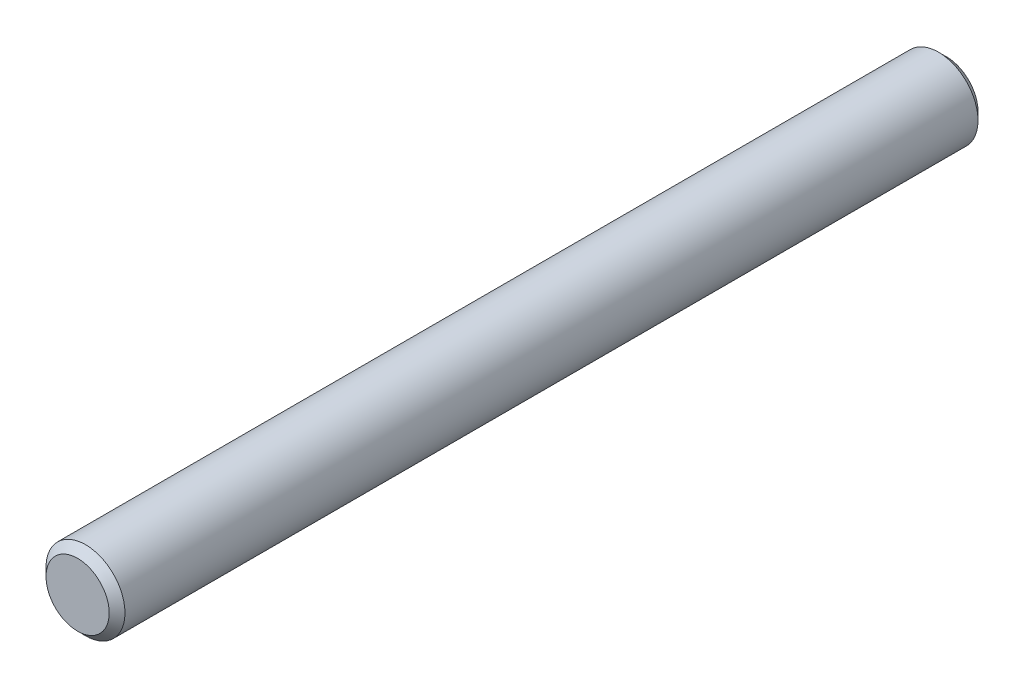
ISO-10303-21;
HEADER;
FILE_DESCRIPTION(('STEP AP214'),'2;1');
FILE_NAME('part.step','',(''),(''),'','','');
FILE_SCHEMA(('AUTOMOTIVE_DESIGN { 1 0 10303 214 1 1 1 1 }'));
ENDSEC;
DATA;
#1=APPLICATION_CONTEXT('core data for automotive mechanical design processes');
#2=APPLICATION_PROTOCOL_DEFINITION('international standard','automotive_design',2000,#1);
#3=PRODUCT_CONTEXT('',#1,'mechanical');
#4=PRODUCT('Part','Part','',(#3));
#5=PRODUCT_RELATED_PRODUCT_CATEGORY('part','',(#4));
#6=PRODUCT_DEFINITION_FORMATION('','',#4);
#7=PRODUCT_DEFINITION_CONTEXT('part definition',#1,'design');
#8=PRODUCT_DEFINITION('design','',#6,#7);
#9=PRODUCT_DEFINITION_SHAPE('','',#8);
#10=(LENGTH_UNIT() NAMED_UNIT(*) SI_UNIT(.MILLI.,.METRE.));
#11=(NAMED_UNIT(*) PLANE_ANGLE_UNIT() SI_UNIT($,.RADIAN.));
#12=(NAMED_UNIT(*) SI_UNIT($,.STERADIAN.) SOLID_ANGLE_UNIT());
#13=UNCERTAINTY_MEASURE_WITH_UNIT(LENGTH_MEASURE(1.E-05),#10,'distance_accuracy_value','');
#14=(GEOMETRIC_REPRESENTATION_CONTEXT(3) GLOBAL_UNCERTAINTY_ASSIGNED_CONTEXT((#13)) GLOBAL_UNIT_ASSIGNED_CONTEXT((#10,
#11,#12)) REPRESENTATION_CONTEXT('',''));
#15=CARTESIAN_POINT('',(0.,0.,0.));
#16=DIRECTION('',(0.,0.,1.));
#17=DIRECTION('',(1.,0.,0.));
#18=AXIS2_PLACEMENT_3D('',#15,#16,#17);
#19=CARTESIAN_POINT('',(0.,0.,110.));
#20=DIRECTION('',(0.,0.,-1.));
#21=DIRECTION('',(-1.,0.,0.));
#22=AXIS2_PLACEMENT_3D('',#19,#20,#21);
#23=CYLINDRICAL_SURFACE('',#22,5.);
#24=CARTESIAN_POINT('',(0.,0.,1.00000000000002));
#25=DIRECTION('',(0.,0.,1.));
#26=DIRECTION('',(1.,0.,0.));
#27=AXIS2_PLACEMENT_3D('',#24,#25,#26);
#28=CIRCLE('',#27,5.);
#29=CARTESIAN_POINT('',(5.,0.,1.00000000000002));
#30=VERTEX_POINT('',#29);
#31=EDGE_CURVE('E37',#30,#30,#28,.T.);
#32=ORIENTED_EDGE('',*,*,#31,.T.);
#33=EDGE_LOOP('',(#32));
#34=FACE_BOUND('',#33,.T.);
#35=CARTESIAN_POINT('',(0.,0.,109.));
#36=DIRECTION('',(0.,0.,1.));
#37=DIRECTION('',(1.,0.,0.));
#38=AXIS2_PLACEMENT_3D('',#35,#36,#37);
#39=CIRCLE('',#38,5.);
#40=CARTESIAN_POINT('',(5.,0.,109.));
#41=VERTEX_POINT('',#40);
#42=EDGE_CURVE('E41',#41,#41,#39,.F.);
#43=ORIENTED_EDGE('',*,*,#42,.T.);
#44=EDGE_LOOP('',(#43));
#45=FACE_BOUND('',#44,.T.);
#46=ADVANCED_FACE('F27',(#34,#45),#23,.T.);
#47=CARTESIAN_POINT('',(0.,0.,110.));
#48=DIRECTION('',(0.,0.,1.));
#49=DIRECTION('',(1.,0.,0.));
#50=AXIS2_PLACEMENT_3D('',#47,#48,#49);
#51=PLANE('',#50);
#52=CARTESIAN_POINT('',(0.,0.,110.));
#53=DIRECTION('',(0.,0.,1.));
#54=DIRECTION('',(1.,0.,0.));
#55=AXIS2_PLACEMENT_3D('',#52,#53,#54);
#56=CIRCLE('',#55,3.99999999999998);
#57=CARTESIAN_POINT('',(3.99999999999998,0.,110.));
#58=VERTEX_POINT('',#57);
#59=EDGE_CURVE('E10',#58,#58,#56,.T.);
#60=ORIENTED_EDGE('',*,*,#59,.T.);
#61=EDGE_LOOP('',(#60));
#62=FACE_BOUND('',#61,.T.);
#63=ADVANCED_FACE('F59',(#62),#51,.T.);
#64=CARTESIAN_POINT('',(0.,0.,0.));
#65=DIRECTION('',(0.,0.,1.));
#66=DIRECTION('',(1.,0.,0.));
#67=AXIS2_PLACEMENT_3D('',#64,#65,#66);
#68=PLANE('',#67);
#69=CARTESIAN_POINT('',(0.,0.,0.));
#70=DIRECTION('',(0.,0.,1.));
#71=DIRECTION('',(1.,0.,0.));
#72=AXIS2_PLACEMENT_3D('',#69,#70,#71);
#73=CIRCLE('',#72,3.99999999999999);
#74=CARTESIAN_POINT('',(3.99999999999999,0.,0.));
#75=VERTEX_POINT('',#74);
#76=EDGE_CURVE('E33',#75,#75,#73,.F.);
#77=ORIENTED_EDGE('',*,*,#76,.T.);
#78=EDGE_LOOP('',(#77));
#79=FACE_BOUND('',#78,.T.);
#80=ADVANCED_FACE('F56',(#79),#68,.F.);
#81=CARTESIAN_POINT('',(0.,0.,1.00000000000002));
#82=DIRECTION('',(0.,0.,1.));
#83=DIRECTION('',(1.,0.,0.));
#84=AXIS2_PLACEMENT_3D('',#81,#82,#83);
#85=CONICAL_SURFACE('',#84,5.,0.785398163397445);
#86=ORIENTED_EDGE('',*,*,#76,.F.);
#87=EDGE_LOOP('',(#86));
#88=FACE_BOUND('',#87,.T.);
#89=ORIENTED_EDGE('',*,*,#31,.F.);
#90=EDGE_LOOP('',(#89));
#91=FACE_BOUND('',#90,.T.);
#92=ADVANCED_FACE('F51',(#88,#91),#85,.T.);
#93=CARTESIAN_POINT('',(0.,0.,110.));
#94=DIRECTION('',(0.,0.,-1.));
#95=DIRECTION('',(-1.,0.,0.));
#96=AXIS2_PLACEMENT_3D('',#93,#94,#95);
#97=CONICAL_SURFACE('',#96,3.99999999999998,0.785398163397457);
#98=ORIENTED_EDGE('',*,*,#42,.F.);
#99=EDGE_LOOP('',(#98));
#100=FACE_BOUND('',#99,.T.);
#101=ORIENTED_EDGE('',*,*,#59,.F.);
#102=EDGE_LOOP('',(#101));
#103=FACE_BOUND('',#102,.T.);
#104=ADVANCED_FACE('F48',(#100,#103),#97,.T.);
#105=CLOSED_SHELL('',(#46,#63,#80,#92,#104));
#106=MANIFOLD_SOLID_BREP('B2',#105);
#107=ADVANCED_BREP_SHAPE_REPRESENTATION('',(#18,#106),#14);
#108=SHAPE_DEFINITION_REPRESENTATION(#9,#107);
ENDSEC;
END-ISO-10303-21;
